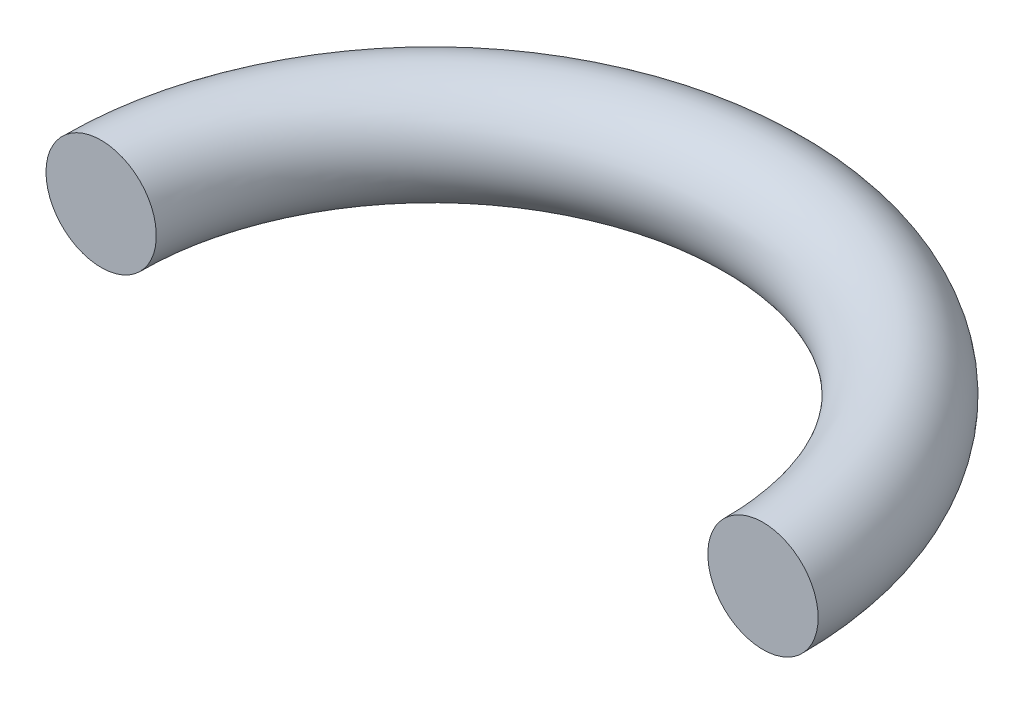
ISO-10303-21;
HEADER;
FILE_DESCRIPTION(('STEP AP214'),'2;1');
FILE_NAME('part.step','',(''),(''),'','','');
FILE_SCHEMA(('AUTOMOTIVE_DESIGN { 1 0 10303 214 1 1 1 1 }'));
ENDSEC;
DATA;
#1=APPLICATION_CONTEXT('core data for automotive mechanical design processes');
#2=APPLICATION_PROTOCOL_DEFINITION('international standard','automotive_design',2000,#1);
#3=PRODUCT_CONTEXT('',#1,'mechanical');
#4=PRODUCT('Part','Part','',(#3));
#5=PRODUCT_RELATED_PRODUCT_CATEGORY('part','',(#4));
#6=PRODUCT_DEFINITION_FORMATION('','',#4);
#7=PRODUCT_DEFINITION_CONTEXT('part definition',#1,'design');
#8=PRODUCT_DEFINITION('design','',#6,#7);
#9=PRODUCT_DEFINITION_SHAPE('','',#8);
#10=(LENGTH_UNIT() NAMED_UNIT(*) SI_UNIT(.MILLI.,.METRE.));
#11=(NAMED_UNIT(*) PLANE_ANGLE_UNIT() SI_UNIT($,.RADIAN.));
#12=(NAMED_UNIT(*) SI_UNIT($,.STERADIAN.) SOLID_ANGLE_UNIT());
#13=UNCERTAINTY_MEASURE_WITH_UNIT(LENGTH_MEASURE(1.E-05),#10,'distance_accuracy_value','');
#14=(GEOMETRIC_REPRESENTATION_CONTEXT(3) GLOBAL_UNCERTAINTY_ASSIGNED_CONTEXT((#13)) GLOBAL_UNIT_ASSIGNED_CONTEXT((#10,
#11,#12)) REPRESENTATION_CONTEXT('',''));
#15=CARTESIAN_POINT('',(0.,0.,0.));
#16=DIRECTION('',(0.,0.,1.));
#17=DIRECTION('',(1.,0.,0.));
#18=AXIS2_PLACEMENT_3D('',#15,#16,#17);
#19=CARTESIAN_POINT('',(0.,0.,0.));
#20=DIRECTION('',(0.,1.,0.));
#21=DIRECTION('',(0.,0.,1.));
#22=AXIS2_PLACEMENT_3D('',#19,#20,#21);
#23=TOROIDAL_SURFACE('',#22,3.,0.5);
#24=CARTESIAN_POINT('',(3.,0.,0.));
#25=DIRECTION('',(0.,0.,-1.));
#26=DIRECTION('',(-1.,0.,0.));
#27=AXIS2_PLACEMENT_3D('',#24,#25,#26);
#28=CIRCLE('',#27,0.5);
#29=CARTESIAN_POINT('',(3.5,0.,0.));
#30=VERTEX_POINT('',#29);
#31=EDGE_CURVE('E10',#30,#30,#28,.T.);
#32=CARTESIAN_POINT('',(-3.,0.,0.));
#33=DIRECTION('',(0.,0.,1.));
#34=DIRECTION('',(1.,0.,0.));
#35=AXIS2_PLACEMENT_3D('',#32,#33,#34);
#36=CIRCLE('',#35,0.5);
#37=CARTESIAN_POINT('',(-3.5,0.,0.));
#38=VERTEX_POINT('',#37);
#39=EDGE_CURVE('E44',#38,#38,#36,.T.);
#40=CARTESIAN_POINT('',(0.,0.,0.));
#41=DIRECTION('',(0.,1.,0.));
#42=DIRECTION('',(0.,0.,1.));
#43=AXIS2_PLACEMENT_3D('',#40,#41,#42);
#44=CIRCLE('',#43,3.5);
#45=EDGE_CURVE('',#30,#38,#44,.T.);
#46=ORIENTED_EDGE('',*,*,#31,.T.);
#47=ORIENTED_EDGE('',*,*,#39,.F.);
#48=ORIENTED_EDGE('',*,*,#45,.T.);
#49=ORIENTED_EDGE('',*,*,#45,.F.);
#50=EDGE_LOOP('',(#46,#48,#47,#49));
#51=FACE_BOUND('',#50,.T.);
#52=ADVANCED_FACE('F37',(#51),#23,.T.);
#53=CARTESIAN_POINT('',(3.,0.,0.));
#54=DIRECTION('',(0.,0.,-1.));
#55=DIRECTION('',(-1.,0.,0.));
#56=AXIS2_PLACEMENT_3D('',#53,#54,#55);
#57=PLANE('',#56);
#58=ORIENTED_EDGE('',*,*,#31,.F.);
#59=EDGE_LOOP('',(#58));
#60=FACE_BOUND('',#59,.T.);
#61=ADVANCED_FACE('F54',(#60),#57,.F.);
#62=CARTESIAN_POINT('',(-3.,0.,0.));
#63=DIRECTION('',(0.,0.,1.));
#64=DIRECTION('',(1.,0.,0.));
#65=AXIS2_PLACEMENT_3D('',#62,#63,#64);
#66=PLANE('',#65);
#67=ORIENTED_EDGE('',*,*,#39,.T.);
#68=EDGE_LOOP('',(#67));
#69=FACE_BOUND('',#68,.T.);
#70=ADVANCED_FACE('F51',(#69),#66,.T.);
#71=CLOSED_SHELL('',(#52,#61,#70));
#72=MANIFOLD_SOLID_BREP('B2',#71);
#73=ADVANCED_BREP_SHAPE_REPRESENTATION('',(#18,#72),#14);
#74=SHAPE_DEFINITION_REPRESENTATION(#9,#73);
ENDSEC;
END-ISO-10303-21;
